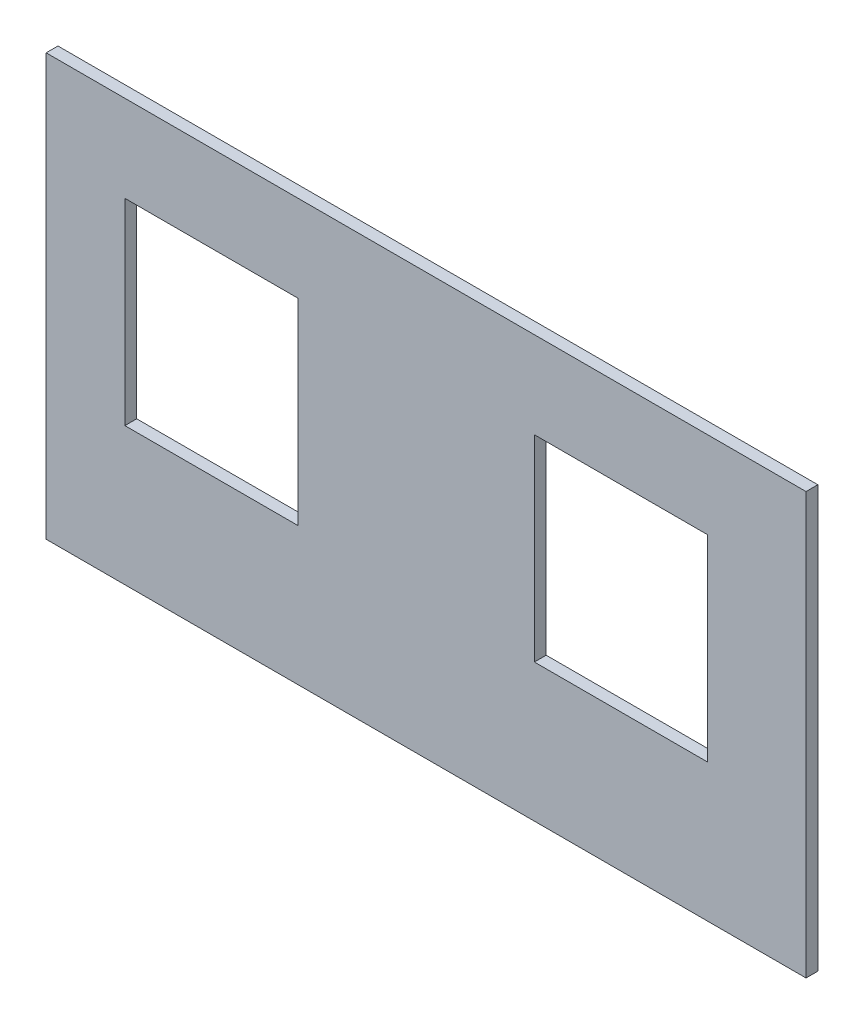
from build123d import *

# Parameters (mm, degrees)
ESQUISSE1_W             = 193
ESQUISSE1_H             = 107
EXTRUSION1_DEPTH        = 3
ESQUISSE2_W             = 44
ESQUISSE2_H             = 50
ENL_V_MAT_EXTRU_1_DEPTH = 3


with BuildPart() as part:
    # Esquisse1 → Extrusion1 (new body)
    with BuildSketch(Plane.XY):
        with Locations((96.5, 53.5)):
            Rectangle(ESQUISSE1_W, ESQUISSE1_H)
    extrude(amount=EXTRUSION1_DEPTH)

    # Esquisse2 → Enl_v. mat.-Extru.1 (cut)
    with BuildSketch(Plane.XY.offset(3)):
        with Locations((42, 60)):
            Rectangle(ESQUISSE2_W, ESQUISSE2_H)
        with Locations((146, 60)):
            Rectangle(ESQUISSE2_W, ESQUISSE2_H)
    extrude(amount=-ENL_V_MAT_EXTRU_1_DEPTH, mode=Mode.SUBTRACT)


solid = part.part
